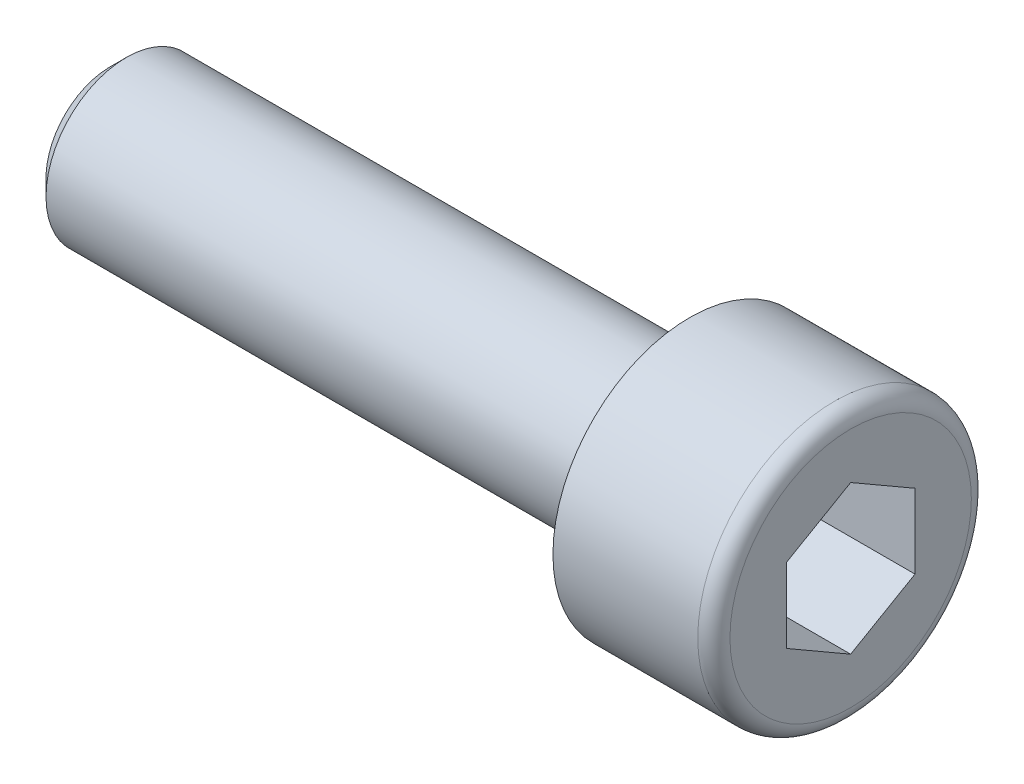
from build123d import *

# Parameters (mm, degrees)
ENL_V_MAT_EXTRU_1_DEPTH = 4
CONG_1_R                = 0.5
CHANFREIN1_SIZE         = 0.5


with BuildPart() as part:
    # Esquisse1 → Base-R_volution (revolve)
    with BuildSketch(Plane.XY, mode=Mode.PRIVATE) as base_r_volution_sk:
        Polygon((-18, 0), (-18, 2.5), (0, 2.5), (0, 4.25), (5, 4.25), (5, 0), align=None)
    revolve(base_r_volution_sk.sketch.rotate(Axis((-120, 0, 0), (1, 0, 0)), 90), axis=Axis((-120, 0, 0), (1, 0, 0)))

    # Esquisse2 → Enl_v. mat.-Extru.1 (cut)
    with BuildSketch(Plane(origin=(5, 0, 0), x_dir=(0, 0, -1), z_dir=(1, 0, 0))):
        Polygon((-2, 1.154700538), (-2, -1.154700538), (0, -2.309401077), (2, -1.154700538), (2, 1.154700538), (0, 2.309401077), align=None)
    extrude(amount=-ENL_V_MAT_EXTRU_1_DEPTH, mode=Mode.SUBTRACT)

    # Cong_1
    cong_1_edges = [part.edges().sort_by_distance(p)[0] for p in [
        (5, 0, -4.25),
    ]]
    fillet(cong_1_edges, radius=CONG_1_R)

    # Chanfrein1
    chanfrein1_edges = [part.edges().sort_by_distance(p)[0] for p in [
        (-18, 0, -2.5),
    ]]
    chamfer(chanfrein1_edges, length=CHANFREIN1_SIZE)


solid = part.part
